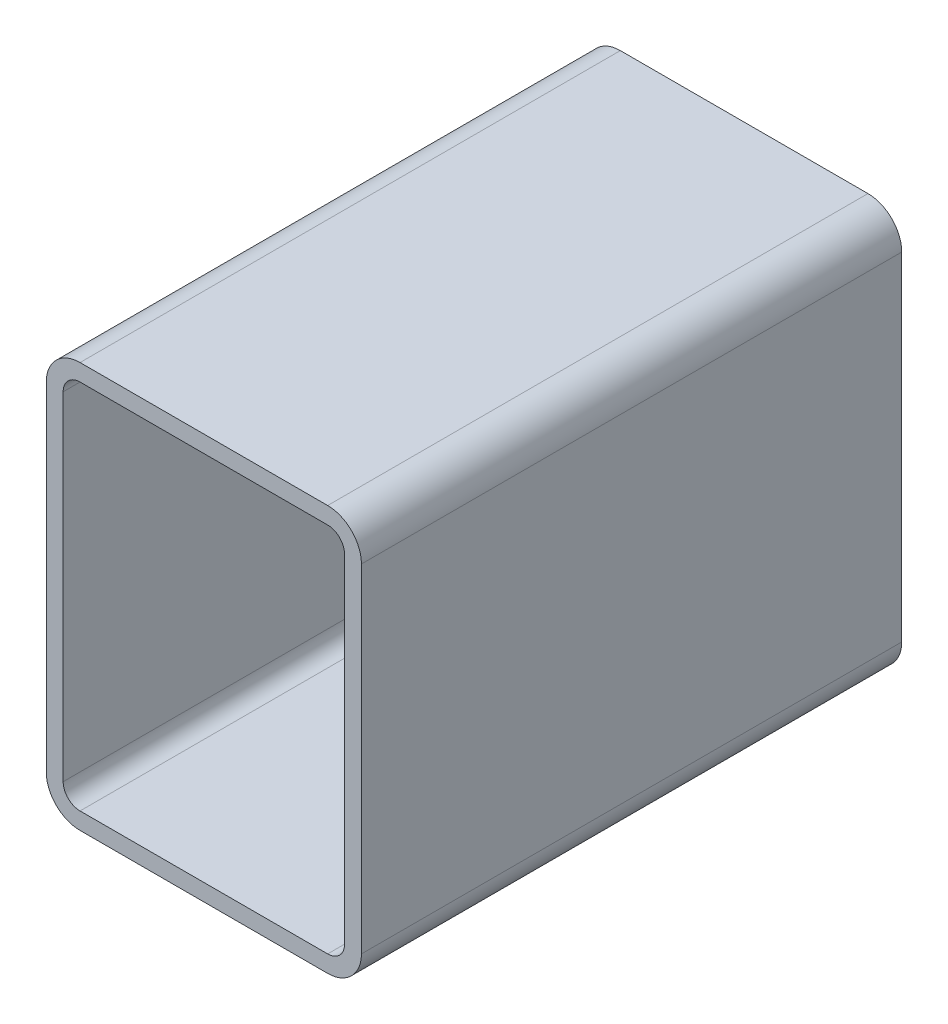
ISO-10303-21;
HEADER;
FILE_DESCRIPTION(('STEP AP214'),'2;1');
FILE_NAME('part.step','',(''),(''),'','','');
FILE_SCHEMA(('AUTOMOTIVE_DESIGN { 1 0 10303 214 1 1 1 1 }'));
ENDSEC;
DATA;
#1=APPLICATION_CONTEXT('core data for automotive mechanical design processes');
#2=APPLICATION_PROTOCOL_DEFINITION('international standard','automotive_design',2000,#1);
#3=PRODUCT_CONTEXT('',#1,'mechanical');
#4=PRODUCT('Part','Part','',(#3));
#5=PRODUCT_RELATED_PRODUCT_CATEGORY('part','',(#4));
#6=PRODUCT_DEFINITION_FORMATION('','',#4);
#7=PRODUCT_DEFINITION_CONTEXT('part definition',#1,'design');
#8=PRODUCT_DEFINITION('design','',#6,#7);
#9=PRODUCT_DEFINITION_SHAPE('','',#8);
#10=(LENGTH_UNIT() NAMED_UNIT(*) SI_UNIT(.MILLI.,.METRE.));
#11=(NAMED_UNIT(*) PLANE_ANGLE_UNIT() SI_UNIT($,.RADIAN.));
#12=(NAMED_UNIT(*) SI_UNIT($,.STERADIAN.) SOLID_ANGLE_UNIT());
#13=UNCERTAINTY_MEASURE_WITH_UNIT(LENGTH_MEASURE(1.E-05),#10,'distance_accuracy_value','');
#14=(GEOMETRIC_REPRESENTATION_CONTEXT(3) GLOBAL_UNCERTAINTY_ASSIGNED_CONTEXT((#13)) GLOBAL_UNIT_ASSIGNED_CONTEXT((#10,
#11,#12)) REPRESENTATION_CONTEXT('',''));
#15=CARTESIAN_POINT('',(0.,0.,0.));
#16=DIRECTION('',(0.,0.,1.));
#17=DIRECTION('',(1.,0.,0.));
#18=AXIS2_PLACEMENT_3D('',#15,#16,#17);
#19=CARTESIAN_POINT('',(21.2548786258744,211.493222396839,304.8));
#20=DIRECTION('',(0.,0.,1.));
#21=DIRECTION('',(1.,0.,0.));
#22=AXIS2_PLACEMENT_3D('',#19,#20,#21);
#23=PLANE('',#22);
#24=CARTESIAN_POINT('',(21.2548786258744,211.493222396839,304.8));
#25=DIRECTION('',(0.,0.,1.));
#26=DIRECTION('',(1.,0.,0.));
#27=AXIS2_PLACEMENT_3D('',#24,#25,#26);
#28=CIRCLE('',#27,19.05);
#29=CARTESIAN_POINT('',(21.2548786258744,230.543222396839,304.8));
#30=VERTEX_POINT('',#29);
#31=CARTESIAN_POINT('',(2.20487862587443,211.493222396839,304.8));
#32=VERTEX_POINT('',#31);
#33=EDGE_CURVE('E211',#30,#32,#28,.T.);
#34=ORIENTED_EDGE('',*,*,#33,.T.);
#35=DIRECTION('',(0.,-1.,0.));
#36=VECTOR('',#35,1.);
#37=CARTESIAN_POINT('',(2.20487862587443,20.9932223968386,304.8));
#38=LINE('',#37,#36);
#39=CARTESIAN_POINT('',(2.20487862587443,20.9932223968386,304.8));
#40=VERTEX_POINT('',#39);
#41=EDGE_CURVE('E214',#32,#40,#38,.T.);
#42=ORIENTED_EDGE('',*,*,#41,.T.);
#43=CARTESIAN_POINT('',(21.2548786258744,20.9932223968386,304.8));
#44=DIRECTION('',(0.,0.,1.));
#45=DIRECTION('',(1.,0.,0.));
#46=AXIS2_PLACEMENT_3D('',#43,#44,#45);
#47=CIRCLE('',#46,19.05);
#48=CARTESIAN_POINT('',(21.2548786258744,1.94322239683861,304.8));
#49=VERTEX_POINT('',#48);
#50=EDGE_CURVE('E217',#40,#49,#47,.T.);
#51=ORIENTED_EDGE('',*,*,#50,.T.);
#52=DIRECTION('',(1.,0.,0.));
#53=VECTOR('',#52,1.);
#54=CARTESIAN_POINT('',(160.954878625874,1.94322239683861,304.8));
#55=LINE('',#54,#53);
#56=CARTESIAN_POINT('',(160.954878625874,1.94322239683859,304.8));
#57=VERTEX_POINT('',#56);
#58=EDGE_CURVE('E219',#49,#57,#55,.T.);
#59=ORIENTED_EDGE('',*,*,#58,.T.);
#60=CARTESIAN_POINT('',(160.954878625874,20.9932223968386,304.8));
#61=DIRECTION('',(0.,0.,1.));
#62=DIRECTION('',(1.,0.,0.));
#63=AXIS2_PLACEMENT_3D('',#60,#61,#62);
#64=CIRCLE('',#63,19.05);
#65=CARTESIAN_POINT('',(180.004878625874,20.9932223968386,304.8));
#66=VERTEX_POINT('',#65);
#67=EDGE_CURVE('E221',#57,#66,#64,.T.);
#68=ORIENTED_EDGE('',*,*,#67,.T.);
#69=DIRECTION('',(0.,1.,0.));
#70=VECTOR('',#69,1.);
#71=CARTESIAN_POINT('',(180.004878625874,211.493222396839,304.8));
#72=LINE('',#71,#70);
#73=CARTESIAN_POINT('',(180.004878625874,211.493222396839,304.8));
#74=VERTEX_POINT('',#73);
#75=EDGE_CURVE('E223',#66,#74,#72,.T.);
#76=ORIENTED_EDGE('',*,*,#75,.T.);
#77=CARTESIAN_POINT('',(160.954878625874,211.493222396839,304.8));
#78=DIRECTION('',(0.,0.,1.));
#79=DIRECTION('',(1.,0.,0.));
#80=AXIS2_PLACEMENT_3D('',#77,#78,#79);
#81=CIRCLE('',#80,19.05);
#82=CARTESIAN_POINT('',(160.954878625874,230.543222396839,304.8));
#83=VERTEX_POINT('',#82);
#84=EDGE_CURVE('E225',#74,#83,#81,.T.);
#85=ORIENTED_EDGE('',*,*,#84,.T.);
#86=DIRECTION('',(-1.,0.,0.));
#87=VECTOR('',#86,1.);
#88=CARTESIAN_POINT('',(21.2548786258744,230.543222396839,304.8));
#89=LINE('',#88,#87);
#90=EDGE_CURVE('E227',#83,#30,#89,.T.);
#91=ORIENTED_EDGE('',*,*,#90,.T.);
#92=EDGE_LOOP('',(#34,#42,#51,#59,#68,#76,#85,#91));
#93=FACE_BOUND('',#92,.T.);
#94=DIRECTION('',(0.,-1.,0.));
#95=VECTOR('',#94,1.);
#96=CARTESIAN_POINT('',(11.7298786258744,20.9932223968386,304.8));
#97=LINE('',#96,#95);
#98=CARTESIAN_POINT('',(11.7298786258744,211.493222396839,304.8));
#99=VERTEX_POINT('',#98);
#100=CARTESIAN_POINT('',(11.7298786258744,20.9932223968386,304.8));
#101=VERTEX_POINT('',#100);
#102=EDGE_CURVE('E154',#99,#101,#97,.T.);
#103=ORIENTED_EDGE('',*,*,#102,.F.);
#104=CARTESIAN_POINT('',(21.2548786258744,211.493222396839,304.8));
#105=DIRECTION('',(0.,0.,1.));
#106=DIRECTION('',(1.,0.,0.));
#107=AXIS2_PLACEMENT_3D('',#104,#105,#106);
#108=CIRCLE('',#107,9.525);
#109=CARTESIAN_POINT('',(21.2548786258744,221.018222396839,304.8));
#110=VERTEX_POINT('',#109);
#111=EDGE_CURVE('E146',#110,#99,#108,.T.);
#112=ORIENTED_EDGE('',*,*,#111,.F.);
#113=DIRECTION('',(-1.,0.,0.));
#114=VECTOR('',#113,1.);
#115=CARTESIAN_POINT('',(21.2548786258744,221.018222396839,304.8));
#116=LINE('',#115,#114);
#117=CARTESIAN_POINT('',(160.954878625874,221.018222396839,304.8));
#118=VERTEX_POINT('',#117);
#119=EDGE_CURVE('E179',#118,#110,#116,.T.);
#120=ORIENTED_EDGE('',*,*,#119,.F.);
#121=CARTESIAN_POINT('',(160.954878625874,211.493222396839,304.8));
#122=DIRECTION('',(0.,0.,1.));
#123=DIRECTION('',(1.,0.,0.));
#124=AXIS2_PLACEMENT_3D('',#121,#122,#123);
#125=CIRCLE('',#124,9.52499999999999);
#126=CARTESIAN_POINT('',(170.479878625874,211.493222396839,304.8));
#127=VERTEX_POINT('',#126);
#128=EDGE_CURVE('E177',#127,#118,#125,.T.);
#129=ORIENTED_EDGE('',*,*,#128,.F.);
#130=DIRECTION('',(0.,1.,0.));
#131=VECTOR('',#130,1.);
#132=CARTESIAN_POINT('',(170.479878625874,211.493222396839,304.8));
#133=LINE('',#132,#131);
#134=CARTESIAN_POINT('',(170.479878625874,20.9932223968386,304.8));
#135=VERTEX_POINT('',#134);
#136=EDGE_CURVE('E175',#135,#127,#133,.T.);
#137=ORIENTED_EDGE('',*,*,#136,.F.);
#138=CARTESIAN_POINT('',(160.954878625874,20.9932223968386,304.8));
#139=DIRECTION('',(0.,0.,1.));
#140=DIRECTION('',(1.,0.,0.));
#141=AXIS2_PLACEMENT_3D('',#138,#139,#140);
#142=CIRCLE('',#141,9.52500000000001);
#143=CARTESIAN_POINT('',(160.954878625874,11.4682223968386,304.8));
#144=VERTEX_POINT('',#143);
#145=EDGE_CURVE('E173',#144,#135,#142,.T.);
#146=ORIENTED_EDGE('',*,*,#145,.F.);
#147=DIRECTION('',(1.,0.,0.));
#148=VECTOR('',#147,1.);
#149=CARTESIAN_POINT('',(160.954878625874,11.4682223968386,304.8));
#150=LINE('',#149,#148);
#151=CARTESIAN_POINT('',(21.2548786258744,11.4682223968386,304.8));
#152=VERTEX_POINT('',#151);
#153=EDGE_CURVE('E169',#152,#144,#150,.T.);
#154=ORIENTED_EDGE('',*,*,#153,.F.);
#155=CARTESIAN_POINT('',(21.2548786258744,20.9932223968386,304.8));
#156=DIRECTION('',(0.,0.,1.));
#157=DIRECTION('',(1.,0.,0.));
#158=AXIS2_PLACEMENT_3D('',#155,#156,#157);
#159=CIRCLE('',#158,9.525);
#160=EDGE_CURVE('E167',#101,#152,#159,.T.);
#161=ORIENTED_EDGE('',*,*,#160,.F.);
#162=EDGE_LOOP('',(#103,#112,#120,#129,#137,#146,#154,#161));
#163=FACE_BOUND('',#162,.T.);
#164=ADVANCED_FACE('F33',(#93,#163),#23,.T.);
#165=CARTESIAN_POINT('',(21.2548786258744,211.493222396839,0.));
#166=DIRECTION('',(0.,0.,1.));
#167=DIRECTION('',(1.,0.,0.));
#168=AXIS2_PLACEMENT_3D('',#165,#166,#167);
#169=PLANE('',#168);
#170=CARTESIAN_POINT('',(21.2548786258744,211.493222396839,0.));
#171=DIRECTION('',(0.,0.,1.));
#172=DIRECTION('',(1.,0.,0.));
#173=AXIS2_PLACEMENT_3D('',#170,#171,#172);
#174=CIRCLE('',#173,19.05);
#175=CARTESIAN_POINT('',(21.2548786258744,230.543222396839,0.));
#176=VERTEX_POINT('',#175);
#177=CARTESIAN_POINT('',(2.20487862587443,211.493222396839,0.));
#178=VERTEX_POINT('',#177);
#179=EDGE_CURVE('E162',#176,#178,#174,.T.);
#180=ORIENTED_EDGE('',*,*,#179,.F.);
#181=DIRECTION('',(-1.,0.,0.));
#182=VECTOR('',#181,1.);
#183=CARTESIAN_POINT('',(21.2548786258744,230.543222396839,0.));
#184=LINE('',#183,#182);
#185=CARTESIAN_POINT('',(160.954878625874,230.543222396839,0.));
#186=VERTEX_POINT('',#185);
#187=EDGE_CURVE('E215',#186,#176,#184,.T.);
#188=ORIENTED_EDGE('',*,*,#187,.F.);
#189=CARTESIAN_POINT('',(160.954878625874,211.493222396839,0.));
#190=DIRECTION('',(0.,0.,1.));
#191=DIRECTION('',(1.,0.,0.));
#192=AXIS2_PLACEMENT_3D('',#189,#190,#191);
#193=CIRCLE('',#192,19.05);
#194=CARTESIAN_POINT('',(180.004878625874,211.493222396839,0.));
#195=VERTEX_POINT('',#194);
#196=EDGE_CURVE('E242',#195,#186,#193,.T.);
#197=ORIENTED_EDGE('',*,*,#196,.F.);
#198=DIRECTION('',(0.,1.,0.));
#199=VECTOR('',#198,1.);
#200=CARTESIAN_POINT('',(180.004878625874,211.493222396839,0.));
#201=LINE('',#200,#199);
#202=CARTESIAN_POINT('',(180.004878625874,20.9932223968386,0.));
#203=VERTEX_POINT('',#202);
#204=EDGE_CURVE('E240',#203,#195,#201,.T.);
#205=ORIENTED_EDGE('',*,*,#204,.F.);
#206=CARTESIAN_POINT('',(160.954878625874,20.9932223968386,0.));
#207=DIRECTION('',(0.,0.,1.));
#208=DIRECTION('',(1.,0.,0.));
#209=AXIS2_PLACEMENT_3D('',#206,#207,#208);
#210=CIRCLE('',#209,19.05);
#211=CARTESIAN_POINT('',(160.954878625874,1.94322239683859,0.));
#212=VERTEX_POINT('',#211);
#213=EDGE_CURVE('E238',#212,#203,#210,.T.);
#214=ORIENTED_EDGE('',*,*,#213,.F.);
#215=DIRECTION('',(1.,0.,0.));
#216=VECTOR('',#215,1.);
#217=CARTESIAN_POINT('',(160.954878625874,1.94322239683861,0.));
#218=LINE('',#217,#216);
#219=CARTESIAN_POINT('',(21.2548786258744,1.94322239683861,0.));
#220=VERTEX_POINT('',#219);
#221=EDGE_CURVE('E236',#220,#212,#218,.T.);
#222=ORIENTED_EDGE('',*,*,#221,.F.);
#223=CARTESIAN_POINT('',(21.2548786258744,20.9932223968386,0.));
#224=DIRECTION('',(0.,0.,1.));
#225=DIRECTION('',(1.,0.,0.));
#226=AXIS2_PLACEMENT_3D('',#223,#224,#225);
#227=CIRCLE('',#226,19.05);
#228=CARTESIAN_POINT('',(2.20487862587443,20.9932223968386,0.));
#229=VERTEX_POINT('',#228);
#230=EDGE_CURVE('E234',#229,#220,#227,.T.);
#231=ORIENTED_EDGE('',*,*,#230,.F.);
#232=DIRECTION('',(0.,-1.,0.));
#233=VECTOR('',#232,1.);
#234=CARTESIAN_POINT('',(2.20487862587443,20.9932223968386,0.));
#235=LINE('',#234,#233);
#236=EDGE_CURVE('E232',#178,#229,#235,.T.);
#237=ORIENTED_EDGE('',*,*,#236,.F.);
#238=EDGE_LOOP('',(#180,#188,#197,#205,#214,#222,#231,#237));
#239=FACE_BOUND('',#238,.T.);
#240=CARTESIAN_POINT('',(21.2548786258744,211.493222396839,0.));
#241=DIRECTION('',(0.,0.,1.));
#242=DIRECTION('',(1.,0.,0.));
#243=AXIS2_PLACEMENT_3D('',#240,#241,#242);
#244=CIRCLE('',#243,9.525);
#245=CARTESIAN_POINT('',(21.2548786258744,221.018222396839,0.));
#246=VERTEX_POINT('',#245);
#247=CARTESIAN_POINT('',(11.7298786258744,211.493222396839,0.));
#248=VERTEX_POINT('',#247);
#249=EDGE_CURVE('E56',#246,#248,#244,.T.);
#250=ORIENTED_EDGE('',*,*,#249,.T.);
#251=DIRECTION('',(0.,-1.,0.));
#252=VECTOR('',#251,1.);
#253=CARTESIAN_POINT('',(11.7298786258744,20.9932223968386,0.));
#254=LINE('',#253,#252);
#255=CARTESIAN_POINT('',(11.7298786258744,20.9932223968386,0.));
#256=VERTEX_POINT('',#255);
#257=EDGE_CURVE('E161',#248,#256,#254,.T.);
#258=ORIENTED_EDGE('',*,*,#257,.T.);
#259=CARTESIAN_POINT('',(21.2548786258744,20.9932223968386,0.));
#260=DIRECTION('',(0.,0.,1.));
#261=DIRECTION('',(1.,0.,0.));
#262=AXIS2_PLACEMENT_3D('',#259,#260,#261);
#263=CIRCLE('',#262,9.525);
#264=CARTESIAN_POINT('',(21.2548786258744,11.4682223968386,0.));
#265=VERTEX_POINT('',#264);
#266=EDGE_CURVE('E183',#256,#265,#263,.T.);
#267=ORIENTED_EDGE('',*,*,#266,.T.);
#268=DIRECTION('',(1.,0.,0.));
#269=VECTOR('',#268,1.);
#270=CARTESIAN_POINT('',(160.954878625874,11.4682223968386,0.));
#271=LINE('',#270,#269);
#272=CARTESIAN_POINT('',(160.954878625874,11.4682223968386,0.));
#273=VERTEX_POINT('',#272);
#274=EDGE_CURVE('E186',#265,#273,#271,.T.);
#275=ORIENTED_EDGE('',*,*,#274,.T.);
#276=CARTESIAN_POINT('',(160.954878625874,20.9932223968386,0.));
#277=DIRECTION('',(0.,0.,1.));
#278=DIRECTION('',(1.,0.,0.));
#279=AXIS2_PLACEMENT_3D('',#276,#277,#278);
#280=CIRCLE('',#279,9.52500000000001);
#281=CARTESIAN_POINT('',(170.479878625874,20.9932223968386,0.));
#282=VERTEX_POINT('',#281);
#283=EDGE_CURVE('E189',#273,#282,#280,.T.);
#284=ORIENTED_EDGE('',*,*,#283,.T.);
#285=DIRECTION('',(0.,1.,0.));
#286=VECTOR('',#285,1.);
#287=CARTESIAN_POINT('',(170.479878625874,211.493222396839,0.));
#288=LINE('',#287,#286);
#289=CARTESIAN_POINT('',(170.479878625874,211.493222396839,0.));
#290=VERTEX_POINT('',#289);
#291=EDGE_CURVE('E192',#282,#290,#288,.T.);
#292=ORIENTED_EDGE('',*,*,#291,.T.);
#293=CARTESIAN_POINT('',(160.954878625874,211.493222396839,0.));
#294=DIRECTION('',(0.,0.,1.));
#295=DIRECTION('',(1.,0.,0.));
#296=AXIS2_PLACEMENT_3D('',#293,#294,#295);
#297=CIRCLE('',#296,9.52499999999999);
#298=CARTESIAN_POINT('',(160.954878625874,221.018222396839,0.));
#299=VERTEX_POINT('',#298);
#300=EDGE_CURVE('E195',#290,#299,#297,.T.);
#301=ORIENTED_EDGE('',*,*,#300,.T.);
#302=DIRECTION('',(-1.,0.,0.));
#303=VECTOR('',#302,1.);
#304=CARTESIAN_POINT('',(21.2548786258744,221.018222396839,0.));
#305=LINE('',#304,#303);
#306=EDGE_CURVE('E155',#299,#246,#305,.T.);
#307=ORIENTED_EDGE('',*,*,#306,.T.);
#308=EDGE_LOOP('',(#250,#258,#267,#275,#284,#292,#301,#307));
#309=FACE_BOUND('',#308,.T.);
#310=ADVANCED_FACE('F272',(#239,#309),#169,.F.);
#311=CARTESIAN_POINT('',(21.2548786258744,211.493222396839,304.8));
#312=DIRECTION('',(0.,0.,-1.));
#313=DIRECTION('',(-1.,0.,0.));
#314=AXIS2_PLACEMENT_3D('',#311,#312,#313);
#315=CYLINDRICAL_SURFACE('',#314,19.05);
#316=ORIENTED_EDGE('',*,*,#179,.T.);
#317=DIRECTION('',(0.,0.,-1.));
#318=VECTOR('',#317,1.);
#319=CARTESIAN_POINT('',(2.20487862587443,211.493222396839,304.8));
#320=LINE('',#319,#318);
#321=EDGE_CURVE('E11',#32,#178,#320,.T.);
#322=ORIENTED_EDGE('',*,*,#321,.F.);
#323=ORIENTED_EDGE('',*,*,#33,.F.);
#324=DIRECTION('',(0.,0.,-1.));
#325=VECTOR('',#324,1.);
#326=CARTESIAN_POINT('',(21.2548786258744,230.543222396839,304.8));
#327=LINE('',#326,#325);
#328=EDGE_CURVE('E229',#30,#176,#327,.T.);
#329=ORIENTED_EDGE('',*,*,#328,.T.);
#330=EDGE_LOOP('',(#316,#322,#323,#329));
#331=FACE_BOUND('',#330,.T.);
#332=ADVANCED_FACE('F35',(#331),#315,.T.);
#333=CARTESIAN_POINT('',(2.20487862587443,20.9932223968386,304.8));
#334=DIRECTION('',(1.,0.,0.));
#335=DIRECTION('',(0.,0.,-1.));
#336=AXIS2_PLACEMENT_3D('',#333,#334,#335);
#337=PLANE('',#336);
#338=ORIENTED_EDGE('',*,*,#236,.T.);
#339=DIRECTION('',(0.,0.,-1.));
#340=VECTOR('',#339,1.);
#341=CARTESIAN_POINT('',(2.20487862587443,20.9932223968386,304.8));
#342=LINE('',#341,#340);
#343=EDGE_CURVE('E41',#40,#229,#342,.T.);
#344=ORIENTED_EDGE('',*,*,#343,.F.);
#345=ORIENTED_EDGE('',*,*,#41,.F.);
#346=ORIENTED_EDGE('',*,*,#321,.T.);
#347=EDGE_LOOP('',(#338,#344,#345,#346));
#348=FACE_BOUND('',#347,.T.);
#349=ADVANCED_FACE('F289',(#348),#337,.F.);
#350=CARTESIAN_POINT('',(21.2548786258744,20.9932223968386,304.8));
#351=DIRECTION('',(0.,0.,-1.));
#352=DIRECTION('',(-1.,0.,0.));
#353=AXIS2_PLACEMENT_3D('',#350,#351,#352);
#354=CYLINDRICAL_SURFACE('',#353,19.05);
#355=ORIENTED_EDGE('',*,*,#230,.T.);
#356=DIRECTION('',(0.,0.,-1.));
#357=VECTOR('',#356,1.);
#358=CARTESIAN_POINT('',(21.2548786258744,1.94322239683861,304.8));
#359=LINE('',#358,#357);
#360=EDGE_CURVE('E259',#49,#220,#359,.T.);
#361=ORIENTED_EDGE('',*,*,#360,.F.);
#362=ORIENTED_EDGE('',*,*,#50,.F.);
#363=ORIENTED_EDGE('',*,*,#343,.T.);
#364=EDGE_LOOP('',(#355,#361,#362,#363));
#365=FACE_BOUND('',#364,.T.);
#366=ADVANCED_FACE('F266',(#365),#354,.T.);
#367=CARTESIAN_POINT('',(160.954878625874,1.94322239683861,304.8));
#368=DIRECTION('',(0.,1.,0.));
#369=DIRECTION('',(0.,0.,1.));
#370=AXIS2_PLACEMENT_3D('',#367,#368,#369);
#371=PLANE('',#370);
#372=ORIENTED_EDGE('',*,*,#221,.T.);
#373=DIRECTION('',(0.,0.,-1.));
#374=VECTOR('',#373,1.);
#375=CARTESIAN_POINT('',(160.954878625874,1.94322239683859,304.8));
#376=LINE('',#375,#374);
#377=EDGE_CURVE('E256',#57,#212,#376,.T.);
#378=ORIENTED_EDGE('',*,*,#377,.F.);
#379=ORIENTED_EDGE('',*,*,#58,.F.);
#380=ORIENTED_EDGE('',*,*,#360,.T.);
#381=EDGE_LOOP('',(#372,#378,#379,#380));
#382=FACE_BOUND('',#381,.T.);
#383=ADVANCED_FACE('F278',(#382),#371,.F.);
#384=CARTESIAN_POINT('',(160.954878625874,20.9932223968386,304.8));
#385=DIRECTION('',(0.,0.,-1.));
#386=DIRECTION('',(-1.,0.,0.));
#387=AXIS2_PLACEMENT_3D('',#384,#385,#386);
#388=CYLINDRICAL_SURFACE('',#387,19.05);
#389=ORIENTED_EDGE('',*,*,#213,.T.);
#390=DIRECTION('',(0.,0.,-1.));
#391=VECTOR('',#390,1.);
#392=CARTESIAN_POINT('',(180.004878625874,20.9932223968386,304.8));
#393=LINE('',#392,#391);
#394=EDGE_CURVE('E253',#66,#203,#393,.T.);
#395=ORIENTED_EDGE('',*,*,#394,.F.);
#396=ORIENTED_EDGE('',*,*,#67,.F.);
#397=ORIENTED_EDGE('',*,*,#377,.T.);
#398=EDGE_LOOP('',(#389,#395,#396,#397));
#399=FACE_BOUND('',#398,.T.);
#400=ADVANCED_FACE('F282',(#399),#388,.T.);
#401=CARTESIAN_POINT('',(180.004878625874,211.493222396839,304.8));
#402=DIRECTION('',(-1.,0.,0.));
#403=DIRECTION('',(0.,0.,1.));
#404=AXIS2_PLACEMENT_3D('',#401,#402,#403);
#405=PLANE('',#404);
#406=ORIENTED_EDGE('',*,*,#204,.T.);
#407=DIRECTION('',(0.,0.,-1.));
#408=VECTOR('',#407,1.);
#409=CARTESIAN_POINT('',(180.004878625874,211.493222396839,304.8));
#410=LINE('',#409,#408);
#411=EDGE_CURVE('E250',#74,#195,#410,.T.);
#412=ORIENTED_EDGE('',*,*,#411,.F.);
#413=ORIENTED_EDGE('',*,*,#75,.F.);
#414=ORIENTED_EDGE('',*,*,#394,.T.);
#415=EDGE_LOOP('',(#406,#412,#413,#414));
#416=FACE_BOUND('',#415,.T.);
#417=ADVANCED_FACE('F302',(#416),#405,.F.);
#418=CARTESIAN_POINT('',(160.954878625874,211.493222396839,304.8));
#419=DIRECTION('',(0.,0.,-1.));
#420=DIRECTION('',(-1.,0.,0.));
#421=AXIS2_PLACEMENT_3D('',#418,#419,#420);
#422=CYLINDRICAL_SURFACE('',#421,19.05);
#423=ORIENTED_EDGE('',*,*,#196,.T.);
#424=DIRECTION('',(0.,0.,-1.));
#425=VECTOR('',#424,1.);
#426=CARTESIAN_POINT('',(160.954878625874,230.543222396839,304.8));
#427=LINE('',#426,#425);
#428=EDGE_CURVE('E247',#83,#186,#427,.T.);
#429=ORIENTED_EDGE('',*,*,#428,.F.);
#430=ORIENTED_EDGE('',*,*,#84,.F.);
#431=ORIENTED_EDGE('',*,*,#411,.T.);
#432=EDGE_LOOP('',(#423,#429,#430,#431));
#433=FACE_BOUND('',#432,.T.);
#434=ADVANCED_FACE('F300',(#433),#422,.T.);
#435=CARTESIAN_POINT('',(21.2548786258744,230.543222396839,304.8));
#436=DIRECTION('',(0.,-1.,0.));
#437=DIRECTION('',(0.,0.,-1.));
#438=AXIS2_PLACEMENT_3D('',#435,#436,#437);
#439=PLANE('',#438);
#440=ORIENTED_EDGE('',*,*,#187,.T.);
#441=ORIENTED_EDGE('',*,*,#328,.F.);
#442=ORIENTED_EDGE('',*,*,#90,.F.);
#443=ORIENTED_EDGE('',*,*,#428,.T.);
#444=EDGE_LOOP('',(#440,#441,#442,#443));
#445=FACE_BOUND('',#444,.T.);
#446=ADVANCED_FACE('F295',(#445),#439,.F.);
#447=CARTESIAN_POINT('',(21.2548786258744,211.493222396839,304.8));
#448=DIRECTION('',(0.,0.,-1.));
#449=DIRECTION('',(-1.,0.,0.));
#450=AXIS2_PLACEMENT_3D('',#447,#448,#449);
#451=CYLINDRICAL_SURFACE('',#450,9.525);
#452=ORIENTED_EDGE('',*,*,#249,.F.);
#453=DIRECTION('',(0.,0.,-1.));
#454=VECTOR('',#453,1.);
#455=CARTESIAN_POINT('',(21.2548786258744,221.018222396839,304.8));
#456=LINE('',#455,#454);
#457=EDGE_CURVE('E150',#110,#246,#456,.T.);
#458=ORIENTED_EDGE('',*,*,#457,.F.);
#459=ORIENTED_EDGE('',*,*,#111,.T.);
#460=DIRECTION('',(0.,0.,-1.));
#461=VECTOR('',#460,1.);
#462=CARTESIAN_POINT('',(11.7298786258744,211.493222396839,304.8));
#463=LINE('',#462,#461);
#464=EDGE_CURVE('E149',#99,#248,#463,.T.);
#465=ORIENTED_EDGE('',*,*,#464,.T.);
#466=EDGE_LOOP('',(#452,#458,#459,#465));
#467=FACE_BOUND('',#466,.T.);
#468=ADVANCED_FACE('F148',(#467),#451,.F.);
#469=CARTESIAN_POINT('',(11.7298786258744,20.9932223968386,304.8));
#470=DIRECTION('',(1.,0.,0.));
#471=DIRECTION('',(0.,0.,-1.));
#472=AXIS2_PLACEMENT_3D('',#469,#470,#471);
#473=PLANE('',#472);
#474=ORIENTED_EDGE('',*,*,#257,.F.);
#475=ORIENTED_EDGE('',*,*,#464,.F.);
#476=ORIENTED_EDGE('',*,*,#102,.T.);
#477=DIRECTION('',(0.,0.,-1.));
#478=VECTOR('',#477,1.);
#479=CARTESIAN_POINT('',(11.7298786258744,20.9932223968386,304.8));
#480=LINE('',#479,#478);
#481=EDGE_CURVE('E163',#101,#256,#480,.T.);
#482=ORIENTED_EDGE('',*,*,#481,.T.);
#483=EDGE_LOOP('',(#474,#475,#476,#482));
#484=FACE_BOUND('',#483,.T.);
#485=ADVANCED_FACE('F158',(#484),#473,.T.);
#486=CARTESIAN_POINT('',(21.2548786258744,20.9932223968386,304.8));
#487=DIRECTION('',(0.,0.,-1.));
#488=DIRECTION('',(-1.,0.,0.));
#489=AXIS2_PLACEMENT_3D('',#486,#487,#488);
#490=CYLINDRICAL_SURFACE('',#489,9.525);
#491=ORIENTED_EDGE('',*,*,#266,.F.);
#492=ORIENTED_EDGE('',*,*,#481,.F.);
#493=ORIENTED_EDGE('',*,*,#160,.T.);
#494=DIRECTION('',(0.,0.,-1.));
#495=VECTOR('',#494,1.);
#496=CARTESIAN_POINT('',(21.2548786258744,11.4682223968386,304.8));
#497=LINE('',#496,#495);
#498=EDGE_CURVE('E208',#152,#265,#497,.T.);
#499=ORIENTED_EDGE('',*,*,#498,.T.);
#500=EDGE_LOOP('',(#491,#492,#493,#499));
#501=FACE_BOUND('',#500,.T.);
#502=ADVANCED_FACE('F327',(#501),#490,.F.);
#503=CARTESIAN_POINT('',(160.954878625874,11.4682223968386,304.8));
#504=DIRECTION('',(0.,1.,0.));
#505=DIRECTION('',(0.,0.,1.));
#506=AXIS2_PLACEMENT_3D('',#503,#504,#505);
#507=PLANE('',#506);
#508=ORIENTED_EDGE('',*,*,#274,.F.);
#509=ORIENTED_EDGE('',*,*,#498,.F.);
#510=ORIENTED_EDGE('',*,*,#153,.T.);
#511=DIRECTION('',(0.,0.,-1.));
#512=VECTOR('',#511,1.);
#513=CARTESIAN_POINT('',(160.954878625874,11.4682223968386,304.8));
#514=LINE('',#513,#512);
#515=EDGE_CURVE('E206',#144,#273,#514,.T.);
#516=ORIENTED_EDGE('',*,*,#515,.T.);
#517=EDGE_LOOP('',(#508,#509,#510,#516));
#518=FACE_BOUND('',#517,.T.);
#519=ADVANCED_FACE('F331',(#518),#507,.T.);
#520=CARTESIAN_POINT('',(160.954878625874,20.9932223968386,304.8));
#521=DIRECTION('',(0.,0.,-1.));
#522=DIRECTION('',(-1.,0.,0.));
#523=AXIS2_PLACEMENT_3D('',#520,#521,#522);
#524=CYLINDRICAL_SURFACE('',#523,9.52500000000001);
#525=ORIENTED_EDGE('',*,*,#283,.F.);
#526=ORIENTED_EDGE('',*,*,#515,.F.);
#527=ORIENTED_EDGE('',*,*,#145,.T.);
#528=DIRECTION('',(0.,0.,-1.));
#529=VECTOR('',#528,1.);
#530=CARTESIAN_POINT('',(170.479878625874,20.9932223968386,304.8));
#531=LINE('',#530,#529);
#532=EDGE_CURVE('E204',#135,#282,#531,.T.);
#533=ORIENTED_EDGE('',*,*,#532,.T.);
#534=EDGE_LOOP('',(#525,#526,#527,#533));
#535=FACE_BOUND('',#534,.T.);
#536=ADVANCED_FACE('F337',(#535),#524,.F.);
#537=CARTESIAN_POINT('',(170.479878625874,211.493222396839,304.8));
#538=DIRECTION('',(-1.,0.,0.));
#539=DIRECTION('',(0.,0.,1.));
#540=AXIS2_PLACEMENT_3D('',#537,#538,#539);
#541=PLANE('',#540);
#542=ORIENTED_EDGE('',*,*,#291,.F.);
#543=ORIENTED_EDGE('',*,*,#532,.F.);
#544=ORIENTED_EDGE('',*,*,#136,.T.);
#545=DIRECTION('',(0.,0.,-1.));
#546=VECTOR('',#545,1.);
#547=CARTESIAN_POINT('',(170.479878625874,211.493222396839,304.8));
#548=LINE('',#547,#546);
#549=EDGE_CURVE('E202',#127,#290,#548,.T.);
#550=ORIENTED_EDGE('',*,*,#549,.T.);
#551=EDGE_LOOP('',(#542,#543,#544,#550));
#552=FACE_BOUND('',#551,.T.);
#553=ADVANCED_FACE('F341',(#552),#541,.T.);
#554=CARTESIAN_POINT('',(160.954878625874,211.493222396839,304.8));
#555=DIRECTION('',(0.,0.,-1.));
#556=DIRECTION('',(-1.,0.,0.));
#557=AXIS2_PLACEMENT_3D('',#554,#555,#556);
#558=CYLINDRICAL_SURFACE('',#557,9.52499999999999);
#559=ORIENTED_EDGE('',*,*,#300,.F.);
#560=ORIENTED_EDGE('',*,*,#549,.F.);
#561=ORIENTED_EDGE('',*,*,#128,.T.);
#562=DIRECTION('',(0.,0.,-1.));
#563=VECTOR('',#562,1.);
#564=CARTESIAN_POINT('',(160.954878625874,221.018222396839,304.8));
#565=LINE('',#564,#563);
#566=EDGE_CURVE('E48',#118,#299,#565,.T.);
#567=ORIENTED_EDGE('',*,*,#566,.T.);
#568=EDGE_LOOP('',(#559,#560,#561,#567));
#569=FACE_BOUND('',#568,.T.);
#570=ADVANCED_FACE('F345',(#569),#558,.F.);
#571=CARTESIAN_POINT('',(21.2548786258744,221.018222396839,304.8));
#572=DIRECTION('',(0.,-1.,0.));
#573=DIRECTION('',(0.,0.,-1.));
#574=AXIS2_PLACEMENT_3D('',#571,#572,#573);
#575=PLANE('',#574);
#576=ORIENTED_EDGE('',*,*,#306,.F.);
#577=ORIENTED_EDGE('',*,*,#566,.F.);
#578=ORIENTED_EDGE('',*,*,#119,.T.);
#579=ORIENTED_EDGE('',*,*,#457,.T.);
#580=EDGE_LOOP('',(#576,#577,#578,#579));
#581=FACE_BOUND('',#580,.T.);
#582=ADVANCED_FACE('F349',(#581),#575,.T.);
#583=CLOSED_SHELL('',(#164,#310,#332,#349,#366,#383,#400,#417,#434,#446,#468,#485,#502,#519,
#536,#553,#570,#582));
#584=MANIFOLD_SOLID_BREP('B2',#583);
#585=ADVANCED_BREP_SHAPE_REPRESENTATION('',(#18,#584),#14);
#586=SHAPE_DEFINITION_REPRESENTATION(#9,#585);
ENDSEC;
END-ISO-10303-21;
